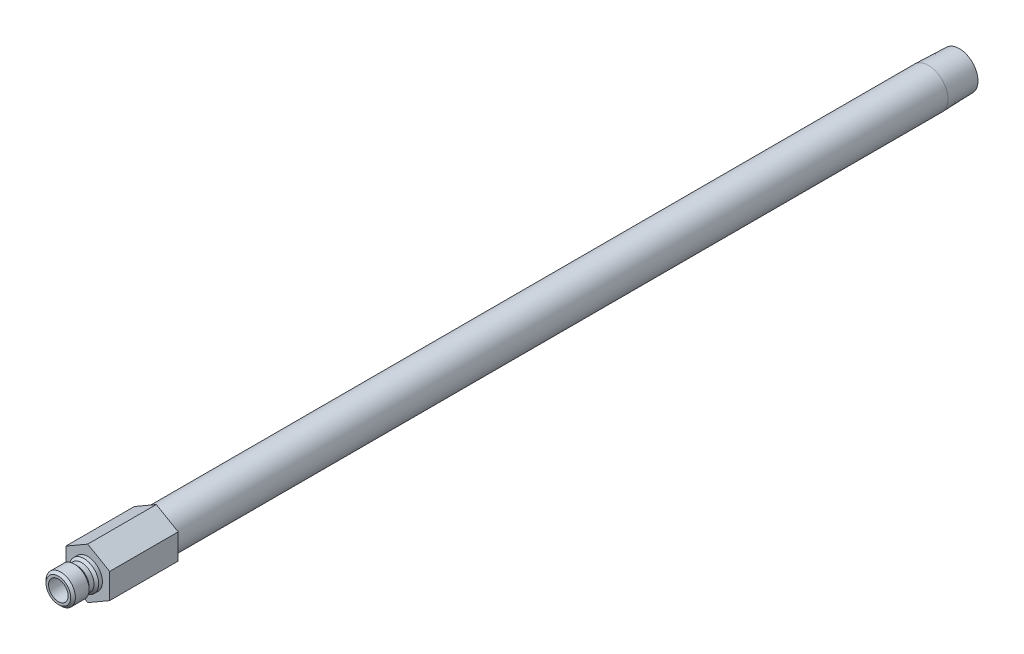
from build123d import *

# Parameters (mm, degrees)
SKETCH2_R           = 3.175
BOSS_EXTRUDE1_DEPTH = 22.225


with BuildPart() as part:
    # Sketch1 → Revolve1 (revolve)
    with BuildSketch(Plane(origin=(0, 0, 0), x_dir=(0, 0, -1), z_dir=(1, 0, 0))):
        Polygon((-9.525, 3.175), (-9.525, 4.0005), (-8.763, 4.7625), (-4.318, 4.7625), (-3.556, 4.0005), (-1.9685, 4.0005), (-1.2065, 4.7625), (0, 4.7625), (0, 6.35), (272.542, 6.35), (282.575, 6.036470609), (282.575, 4.6228), (22.225, 4.6228), (22.225, 3.175), align=None)
    revolve(axis=Axis((0, 0, 0), (0, 0, 1)))

    # Sketch2 → Boss-Extrude1 (add)
    with BuildSketch(Plane.XY):
        Polygon((-7.112, 4.106115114), (-7.112, -4.106115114), (0, -8.212230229), (7.112, -4.106115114), (7.112, 4.106115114), (0, 8.212230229), align=None)
        with Locations(Location((0, 0, 0), (0, 0, 90))):
            Circle(SKETCH2_R, mode=Mode.SUBTRACT)
    extrude(amount=-BOSS_EXTRUDE1_DEPTH)


solid = part.part
